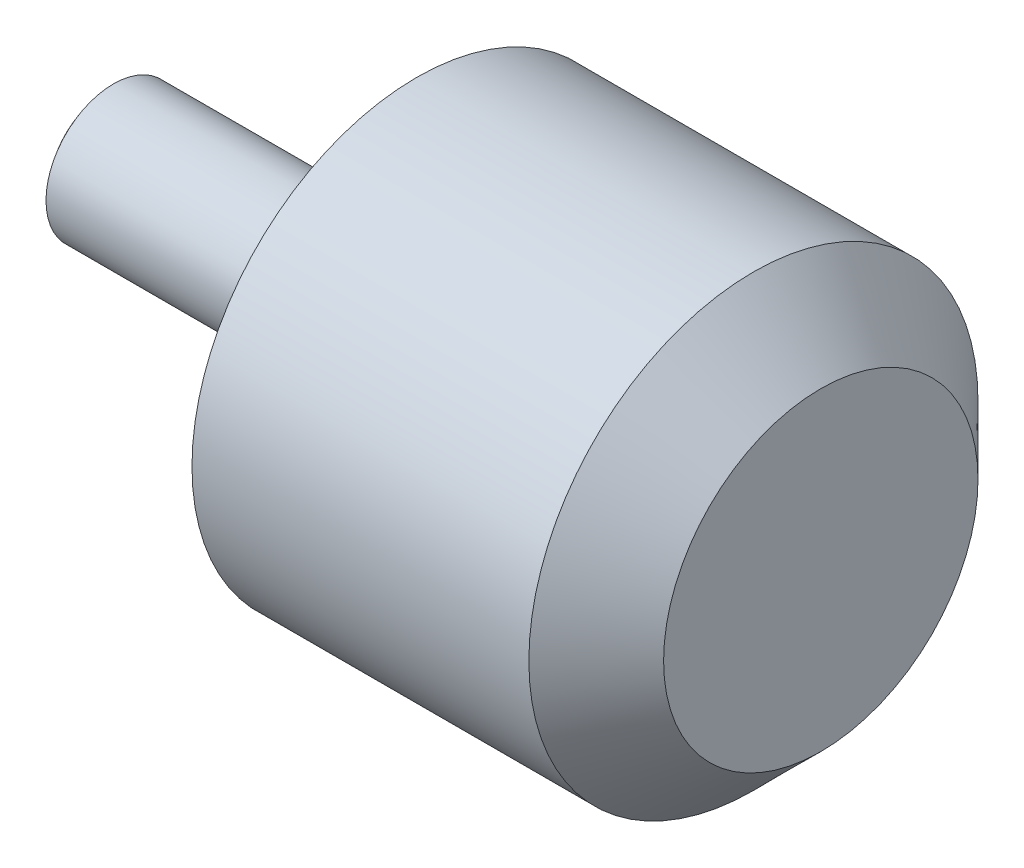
ISO-10303-21;
HEADER;
FILE_DESCRIPTION(('STEP AP214'),'2;1');
FILE_NAME('part.step','',(''),(''),'','','');
FILE_SCHEMA(('AUTOMOTIVE_DESIGN { 1 0 10303 214 1 1 1 1 }'));
ENDSEC;
DATA;
#1=APPLICATION_CONTEXT('core data for automotive mechanical design processes');
#2=APPLICATION_PROTOCOL_DEFINITION('international standard','automotive_design',2000,#1);
#3=PRODUCT_CONTEXT('',#1,'mechanical');
#4=PRODUCT('Part','Part','',(#3));
#5=PRODUCT_RELATED_PRODUCT_CATEGORY('part','',(#4));
#6=PRODUCT_DEFINITION_FORMATION('','',#4);
#7=PRODUCT_DEFINITION_CONTEXT('part definition',#1,'design');
#8=PRODUCT_DEFINITION('design','',#6,#7);
#9=PRODUCT_DEFINITION_SHAPE('','',#8);
#10=(LENGTH_UNIT() NAMED_UNIT(*) SI_UNIT(.MILLI.,.METRE.));
#11=(NAMED_UNIT(*) PLANE_ANGLE_UNIT() SI_UNIT($,.RADIAN.));
#12=(NAMED_UNIT(*) SI_UNIT($,.STERADIAN.) SOLID_ANGLE_UNIT());
#13=UNCERTAINTY_MEASURE_WITH_UNIT(LENGTH_MEASURE(1.E-05),#10,'distance_accuracy_value','');
#14=(GEOMETRIC_REPRESENTATION_CONTEXT(3) GLOBAL_UNCERTAINTY_ASSIGNED_CONTEXT((#13)) GLOBAL_UNIT_ASSIGNED_CONTEXT((#10,
#11,#12)) REPRESENTATION_CONTEXT('',''));
#15=CARTESIAN_POINT('',(0.,0.,0.));
#16=DIRECTION('',(0.,0.,1.));
#17=DIRECTION('',(1.,0.,0.));
#18=AXIS2_PLACEMENT_3D('',#15,#16,#17);
#19=CARTESIAN_POINT('',(4.73057251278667,0.,0.));
#20=DIRECTION('',(-1.,0.,0.));
#21=DIRECTION('',(0.,0.,-1.));
#22=AXIS2_PLACEMENT_3D('',#19,#20,#21);
#23=SPHERICAL_SURFACE('',#22,4.73057251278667);
#24=CARTESIAN_POINT('',(1.07293443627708,0.,0.));
#25=DIRECTION('',(-1.,0.,0.));
#26=DIRECTION('',(0.,0.,1.));
#27=AXIS2_PLACEMENT_3D('',#24,#25,#26);
#28=CIRCLE('',#27,3.);
#29=CARTESIAN_POINT('',(1.07293443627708,0.,3.));
#30=VERTEX_POINT('',#29);
#31=EDGE_CURVE('E56',#30,#30,#28,.T.);
#32=ORIENTED_EDGE('',*,*,#31,.T.);
#33=EDGE_LOOP('',(#32));
#34=FACE_BOUND('',#33,.T.);
#35=ADVANCED_FACE('F31',(#34),#23,.T.);
#36=CARTESIAN_POINT('',(32.5729344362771,0.,0.));
#37=DIRECTION('',(-1.,0.,0.));
#38=DIRECTION('',(0.,0.,1.));
#39=AXIS2_PLACEMENT_3D('',#36,#37,#38);
#40=PLANE('',#39);
#41=CARTESIAN_POINT('',(32.5729344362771,0.,0.));
#42=DIRECTION('',(-1.,0.,0.));
#43=DIRECTION('',(0.,0.,1.));
#44=AXIS2_PLACEMENT_3D('',#41,#42,#43);
#45=CIRCLE('',#44,7.);
#46=CARTESIAN_POINT('',(32.5729344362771,0.,7.));
#47=VERTEX_POINT('',#46);
#48=EDGE_CURVE('E10',#47,#47,#45,.T.);
#49=ORIENTED_EDGE('',*,*,#48,.F.);
#50=EDGE_LOOP('',(#49));
#51=FACE_BOUND('',#50,.T.);
#52=ADVANCED_FACE('F92',(#51),#40,.F.);
#53=CARTESIAN_POINT('',(32.5729344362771,0.,0.));
#54=DIRECTION('',(-1.,0.,0.));
#55=DIRECTION('',(0.,0.,1.));
#56=AXIS2_PLACEMENT_3D('',#53,#54,#55);
#57=CONICAL_SURFACE('',#56,7.,0.785398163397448);
#58=CARTESIAN_POINT('',(29.5729344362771,0.,0.));
#59=DIRECTION('',(-1.,0.,0.));
#60=DIRECTION('',(0.,0.,1.));
#61=AXIS2_PLACEMENT_3D('',#58,#59,#60);
#62=CIRCLE('',#61,10.);
#63=CARTESIAN_POINT('',(29.5729344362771,0.,10.));
#64=VERTEX_POINT('',#63);
#65=EDGE_CURVE('E37',#64,#64,#62,.T.);
#66=ORIENTED_EDGE('',*,*,#65,.F.);
#67=EDGE_LOOP('',(#66));
#68=FACE_BOUND('',#67,.T.);
#69=ORIENTED_EDGE('',*,*,#48,.T.);
#70=EDGE_LOOP('',(#69));
#71=FACE_BOUND('',#70,.T.);
#72=ADVANCED_FACE('F87',(#68,#71),#57,.T.);
#73=CARTESIAN_POINT('',(0.,0.,0.));
#74=DIRECTION('',(-1.,0.,0.));
#75=DIRECTION('',(0.,0.,1.));
#76=AXIS2_PLACEMENT_3D('',#73,#74,#75);
#77=CYLINDRICAL_SURFACE('',#76,10.);
#78=CARTESIAN_POINT('',(14.5729344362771,0.,0.));
#79=DIRECTION('',(-1.,0.,0.));
#80=DIRECTION('',(0.,0.,1.));
#81=AXIS2_PLACEMENT_3D('',#78,#79,#80);
#82=CIRCLE('',#81,10.);
#83=CARTESIAN_POINT('',(14.5729344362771,0.,10.));
#84=VERTEX_POINT('',#83);
#85=EDGE_CURVE('E41',#84,#84,#82,.T.);
#86=ORIENTED_EDGE('',*,*,#85,.F.);
#87=EDGE_LOOP('',(#86));
#88=FACE_BOUND('',#87,.T.);
#89=ORIENTED_EDGE('',*,*,#65,.T.);
#90=EDGE_LOOP('',(#89));
#91=FACE_BOUND('',#90,.T.);
#92=ADVANCED_FACE('F82',(#88,#91),#77,.T.);
#93=CARTESIAN_POINT('',(14.5729344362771,0.,-10.));
#94=DIRECTION('',(1.,0.,0.));
#95=DIRECTION('',(0.,0.,-1.));
#96=AXIS2_PLACEMENT_3D('',#93,#94,#95);
#97=PLANE('',#96);
#98=CARTESIAN_POINT('',(14.5729344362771,0.,0.));
#99=DIRECTION('',(-1.,0.,0.));
#100=DIRECTION('',(0.,0.,1.));
#101=AXIS2_PLACEMENT_3D('',#98,#99,#100);
#102=CIRCLE('',#101,5.);
#103=CARTESIAN_POINT('',(14.5729344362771,0.,5.));
#104=VERTEX_POINT('',#103);
#105=EDGE_CURVE('E45',#104,#104,#102,.T.);
#106=ORIENTED_EDGE('',*,*,#105,.F.);
#107=EDGE_LOOP('',(#106));
#108=FACE_BOUND('',#107,.T.);
#109=ORIENTED_EDGE('',*,*,#85,.T.);
#110=EDGE_LOOP('',(#109));
#111=FACE_BOUND('',#110,.T.);
#112=ADVANCED_FACE('F76',(#108,#111),#97,.F.);
#113=CARTESIAN_POINT('',(0.,0.,0.));
#114=DIRECTION('',(-1.,0.,0.));
#115=DIRECTION('',(0.,0.,1.));
#116=AXIS2_PLACEMENT_3D('',#113,#114,#115);
#117=CYLINDRICAL_SURFACE('',#116,5.);
#118=CARTESIAN_POINT('',(11.0729344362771,0.,0.));
#119=DIRECTION('',(-1.,0.,0.));
#120=DIRECTION('',(0.,0.,1.));
#121=AXIS2_PLACEMENT_3D('',#118,#119,#120);
#122=CIRCLE('',#121,5.);
#123=CARTESIAN_POINT('',(11.0729344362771,0.,5.));
#124=VERTEX_POINT('',#123);
#125=EDGE_CURVE('E50',#124,#124,#122,.T.);
#126=ORIENTED_EDGE('',*,*,#125,.F.);
#127=EDGE_LOOP('',(#126));
#128=FACE_BOUND('',#127,.T.);
#129=ORIENTED_EDGE('',*,*,#105,.T.);
#130=EDGE_LOOP('',(#129));
#131=FACE_BOUND('',#130,.T.);
#132=ADVANCED_FACE('F70',(#128,#131),#117,.T.);
#133=CARTESIAN_POINT('',(11.0729344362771,0.,-5.));
#134=DIRECTION('',(1.,0.,0.));
#135=DIRECTION('',(0.,0.,-1.));
#136=AXIS2_PLACEMENT_3D('',#133,#134,#135);
#137=PLANE('',#136);
#138=CARTESIAN_POINT('',(11.0729344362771,0.,0.));
#139=DIRECTION('',(-1.,0.,0.));
#140=DIRECTION('',(0.,0.,1.));
#141=AXIS2_PLACEMENT_3D('',#138,#139,#140);
#142=CIRCLE('',#141,3.);
#143=CARTESIAN_POINT('',(11.0729344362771,0.,3.));
#144=VERTEX_POINT('',#143);
#145=EDGE_CURVE('E53',#144,#144,#142,.T.);
#146=ORIENTED_EDGE('',*,*,#145,.F.);
#147=EDGE_LOOP('',(#146));
#148=FACE_BOUND('',#147,.T.);
#149=ORIENTED_EDGE('',*,*,#125,.T.);
#150=EDGE_LOOP('',(#149));
#151=FACE_BOUND('',#150,.T.);
#152=ADVANCED_FACE('F64',(#148,#151),#137,.F.);
#153=CARTESIAN_POINT('',(0.,0.,0.));
#154=DIRECTION('',(-1.,0.,0.));
#155=DIRECTION('',(0.,0.,1.));
#156=AXIS2_PLACEMENT_3D('',#153,#154,#155);
#157=CYLINDRICAL_SURFACE('',#156,3.);
#158=ORIENTED_EDGE('',*,*,#31,.F.);
#159=EDGE_LOOP('',(#158));
#160=FACE_BOUND('',#159,.T.);
#161=ORIENTED_EDGE('',*,*,#145,.T.);
#162=EDGE_LOOP('',(#161));
#163=FACE_BOUND('',#162,.T.);
#164=ADVANCED_FACE('F61',(#160,#163),#157,.T.);
#165=CLOSED_SHELL('',(#35,#52,#72,#92,#112,#132,#152,#164));
#166=MANIFOLD_SOLID_BREP('B2',#165);
#167=ADVANCED_BREP_SHAPE_REPRESENTATION('',(#18,#166),#14);
#168=SHAPE_DEFINITION_REPRESENTATION(#9,#167);
ENDSEC;
END-ISO-10303-21;
